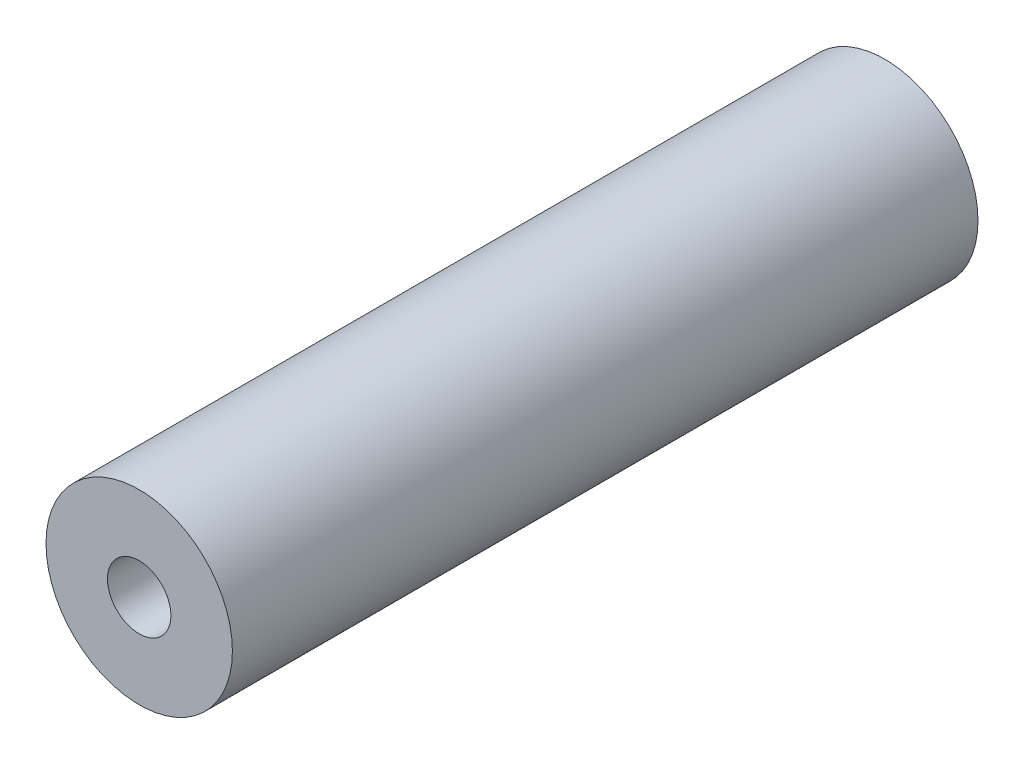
from build123d import *

# Parameters (mm, degrees)
SKETCH1_R           = 9.525
SKETCH1_R_2         = 3.2385
BOSS_EXTRUDE1_DEPTH = 38.1


with BuildPart() as part:
    # Sketch1 → Boss-Extrude1 (new, symmetric)
    with BuildSketch(Plane.XY):
        with Locations(Location((0, 0, 0), (0, 0, 180))):
            Circle(SKETCH1_R)
        with Locations(Location((0, 0, 0), (0, 0, 180))):
            Circle(SKETCH1_R_2, mode=Mode.SUBTRACT)
    extrude(amount=BOSS_EXTRUDE1_DEPTH, both=True)


solid = part.part
